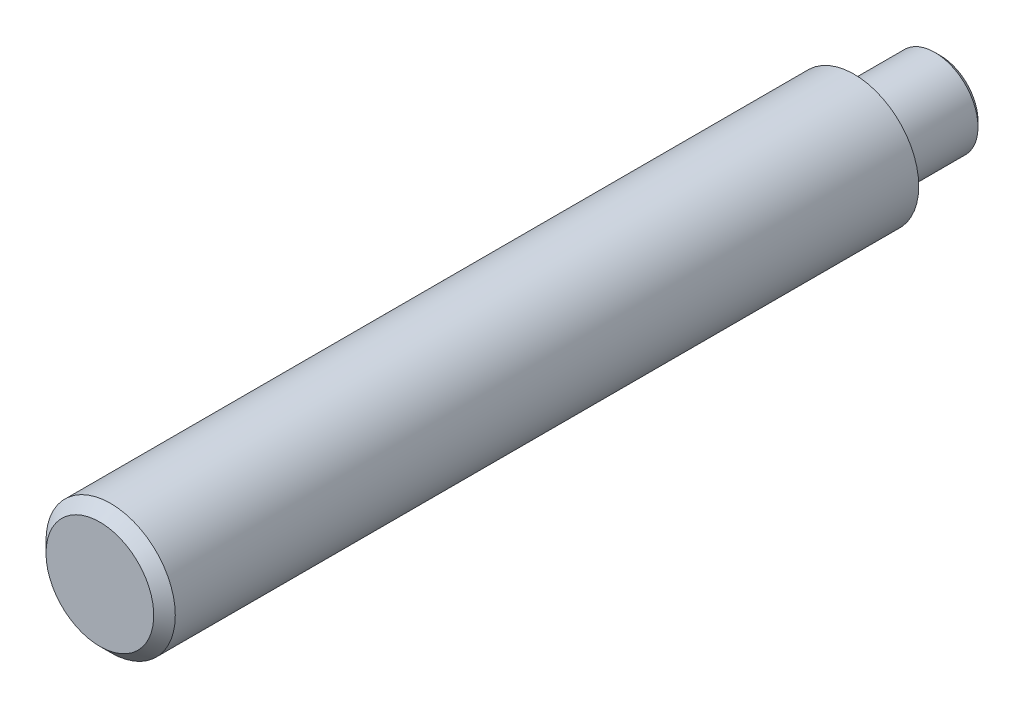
ISO-10303-21;
HEADER;
FILE_DESCRIPTION(('STEP AP214'),'2;1');
FILE_NAME('part.step','',(''),(''),'','','');
FILE_SCHEMA(('AUTOMOTIVE_DESIGN { 1 0 10303 214 1 1 1 1 }'));
ENDSEC;
DATA;
#1=APPLICATION_CONTEXT('core data for automotive mechanical design processes');
#2=APPLICATION_PROTOCOL_DEFINITION('international standard','automotive_design',2000,#1);
#3=PRODUCT_CONTEXT('',#1,'mechanical');
#4=PRODUCT('Part','Part','',(#3));
#5=PRODUCT_RELATED_PRODUCT_CATEGORY('part','',(#4));
#6=PRODUCT_DEFINITION_FORMATION('','',#4);
#7=PRODUCT_DEFINITION_CONTEXT('part definition',#1,'design');
#8=PRODUCT_DEFINITION('design','',#6,#7);
#9=PRODUCT_DEFINITION_SHAPE('','',#8);
#10=(LENGTH_UNIT() NAMED_UNIT(*) SI_UNIT(.MILLI.,.METRE.));
#11=(NAMED_UNIT(*) PLANE_ANGLE_UNIT() SI_UNIT($,.RADIAN.));
#12=(NAMED_UNIT(*) SI_UNIT($,.STERADIAN.) SOLID_ANGLE_UNIT());
#13=UNCERTAINTY_MEASURE_WITH_UNIT(LENGTH_MEASURE(1.E-05),#10,'distance_accuracy_value','');
#14=(GEOMETRIC_REPRESENTATION_CONTEXT(3) GLOBAL_UNCERTAINTY_ASSIGNED_CONTEXT((#13)) GLOBAL_UNIT_ASSIGNED_CONTEXT((#10,
#11,#12)) REPRESENTATION_CONTEXT('',''));
#15=CARTESIAN_POINT('',(0.,0.,0.));
#16=DIRECTION('',(0.,0.,1.));
#17=DIRECTION('',(1.,0.,0.));
#18=AXIS2_PLACEMENT_3D('',#15,#16,#17);
#19=CARTESIAN_POINT('',(0.,0.,-8.));
#20=DIRECTION('',(0.,0.,1.));
#21=DIRECTION('',(1.,0.,0.));
#22=AXIS2_PLACEMENT_3D('',#19,#20,#21);
#23=PLANE('',#22);
#24=CARTESIAN_POINT('',(0.,0.,-8.00000000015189));
#25=DIRECTION('',(0.,0.,1.));
#26=DIRECTION('',(1.,0.,0.));
#27=AXIS2_PLACEMENT_3D('',#24,#25,#26);
#28=CIRCLE('',#27,3.50000000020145);
#29=CARTESIAN_POINT('',(3.50000000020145,0.,-8.00000000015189));
#30=VERTEX_POINT('',#29);
#31=EDGE_CURVE('E17',#30,#30,#28,.T.);
#32=ORIENTED_EDGE('',*,*,#31,.F.);
#33=EDGE_LOOP('',(#32));
#34=FACE_BOUND('',#33,.T.);
#35=ADVANCED_FACE('F14',(#34),#23,.F.);
#36=CARTESIAN_POINT('',(0.,0.,-7.49999999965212));
#37=DIRECTION('',(0.,0.,1.));
#38=DIRECTION('',(1.,0.,0.));
#39=AXIS2_PLACEMENT_3D('',#36,#37,#38);
#40=CONICAL_SURFACE('',#39,3.99999999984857,0.785398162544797);
#41=CARTESIAN_POINT('',(0.,0.,-7.5));
#42=DIRECTION('',(0.,0.,-1.));
#43=DIRECTION('',(-1.,0.,0.));
#44=AXIS2_PLACEMENT_3D('',#41,#42,#43);
#45=CIRCLE('',#44,4.);
#46=CARTESIAN_POINT('',(-4.,0.,-7.5));
#47=VERTEX_POINT('',#46);
#48=EDGE_CURVE('E31',#47,#47,#45,.F.);
#49=ORIENTED_EDGE('',*,*,#48,.F.);
#50=EDGE_LOOP('',(#49));
#51=FACE_BOUND('',#50,.T.);
#52=ORIENTED_EDGE('',*,*,#31,.T.);
#53=EDGE_LOOP('',(#52));
#54=FACE_BOUND('',#53,.T.);
#55=ADVANCED_FACE('F47',(#51,#54),#40,.T.);
#56=CARTESIAN_POINT('',(0.,0.,0.));
#57=DIRECTION('',(0.,0.,-1.));
#58=DIRECTION('',(-1.,0.,0.));
#59=AXIS2_PLACEMENT_3D('',#56,#57,#58);
#60=CYLINDRICAL_SURFACE('',#59,4.);
#61=ORIENTED_EDGE('',*,*,#48,.T.);
#62=EDGE_LOOP('',(#61));
#63=FACE_BOUND('',#62,.T.);
#64=CARTESIAN_POINT('',(0.,0.,0.));
#65=DIRECTION('',(0.,0.,-1.));
#66=DIRECTION('',(-1.,0.,0.));
#67=AXIS2_PLACEMENT_3D('',#64,#65,#66);
#68=CIRCLE('',#67,4.);
#69=CARTESIAN_POINT('',(-4.,0.,0.));
#70=VERTEX_POINT('',#69);
#71=EDGE_CURVE('E34',#70,#70,#68,.F.);
#72=ORIENTED_EDGE('',*,*,#71,.F.);
#73=EDGE_LOOP('',(#72));
#74=FACE_BOUND('',#73,.T.);
#75=ADVANCED_FACE('F44',(#63,#74),#60,.T.);
#76=CARTESIAN_POINT('',(0.,0.,70.));
#77=DIRECTION('',(0.,0.,-1.));
#78=DIRECTION('',(-1.,0.,0.));
#79=AXIS2_PLACEMENT_3D('',#76,#77,#78);
#80=PLANE('',#79);
#81=CARTESIAN_POINT('',(0.,0.,70.0000000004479));
#82=DIRECTION('',(0.,0.,-1.));
#83=DIRECTION('',(-1.,0.,0.));
#84=AXIS2_PLACEMENT_3D('',#81,#82,#83);
#85=CIRCLE('',#84,5.00000000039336);
#86=CARTESIAN_POINT('',(-5.00000000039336,0.,70.0000000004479));
#87=VERTEX_POINT('',#86);
#88=EDGE_CURVE('E26',#87,#87,#85,.T.);
#89=ORIENTED_EDGE('',*,*,#88,.F.);
#90=EDGE_LOOP('',(#89));
#91=FACE_BOUND('',#90,.T.);
#92=ADVANCED_FACE('F46',(#91),#80,.F.);
#93=CARTESIAN_POINT('',(0.,0.,0.));
#94=DIRECTION('',(0.,0.,-1.));
#95=DIRECTION('',(-1.,0.,0.));
#96=AXIS2_PLACEMENT_3D('',#93,#94,#95);
#97=PLANE('',#96);
#98=ORIENTED_EDGE('',*,*,#71,.T.);
#99=EDGE_LOOP('',(#98));
#100=FACE_BOUND('',#99,.T.);
#101=CARTESIAN_POINT('',(0.,0.,0.));
#102=DIRECTION('',(0.,0.,1.));
#103=DIRECTION('',(1.,0.,0.));
#104=AXIS2_PLACEMENT_3D('',#101,#102,#103);
#105=CIRCLE('',#104,6.);
#106=CARTESIAN_POINT('',(6.,0.,0.));
#107=VERTEX_POINT('',#106);
#108=EDGE_CURVE('E21',#107,#107,#105,.T.);
#109=ORIENTED_EDGE('',*,*,#108,.F.);
#110=EDGE_LOOP('',(#109));
#111=FACE_BOUND('',#110,.T.);
#112=ADVANCED_FACE('F41',(#100,#111),#97,.T.);
#113=CARTESIAN_POINT('',(0.,0.,68.9999999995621));
#114=DIRECTION('',(0.,0.,-1.));
#115=DIRECTION('',(-1.,0.,0.));
#116=AXIS2_PLACEMENT_3D('',#113,#114,#115);
#117=CONICAL_SURFACE('',#116,5.99999999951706,0.785398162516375);
#118=CARTESIAN_POINT('',(0.,0.,69.));
#119=DIRECTION('',(0.,0.,1.));
#120=DIRECTION('',(1.,0.,0.));
#121=AXIS2_PLACEMENT_3D('',#118,#119,#120);
#122=CIRCLE('',#121,6.);
#123=CARTESIAN_POINT('',(6.,0.,69.));
#124=VERTEX_POINT('',#123);
#125=EDGE_CURVE('E10',#124,#124,#122,.F.);
#126=ORIENTED_EDGE('',*,*,#125,.F.);
#127=EDGE_LOOP('',(#126));
#128=FACE_BOUND('',#127,.T.);
#129=ORIENTED_EDGE('',*,*,#88,.T.);
#130=EDGE_LOOP('',(#129));
#131=FACE_BOUND('',#130,.T.);
#132=ADVANCED_FACE('F60',(#128,#131),#117,.T.);
#133=CARTESIAN_POINT('',(0.,0.,0.));
#134=DIRECTION('',(0.,0.,1.));
#135=DIRECTION('',(1.,0.,0.));
#136=AXIS2_PLACEMENT_3D('',#133,#134,#135);
#137=CYLINDRICAL_SURFACE('',#136,6.);
#138=ORIENTED_EDGE('',*,*,#125,.T.);
#139=EDGE_LOOP('',(#138));
#140=FACE_BOUND('',#139,.T.);
#141=ORIENTED_EDGE('',*,*,#108,.T.);
#142=EDGE_LOOP('',(#141));
#143=FACE_BOUND('',#142,.T.);
#144=ADVANCED_FACE('F58',(#140,#143),#137,.T.);
#145=CLOSED_SHELL('',(#35,#55,#75,#92,#112,#132,#144));
#146=MANIFOLD_SOLID_BREP('B1',#145);
#147=ADVANCED_BREP_SHAPE_REPRESENTATION('',(#18,#146),#14);
#148=SHAPE_DEFINITION_REPRESENTATION(#9,#147);
ENDSEC;
END-ISO-10303-21;
